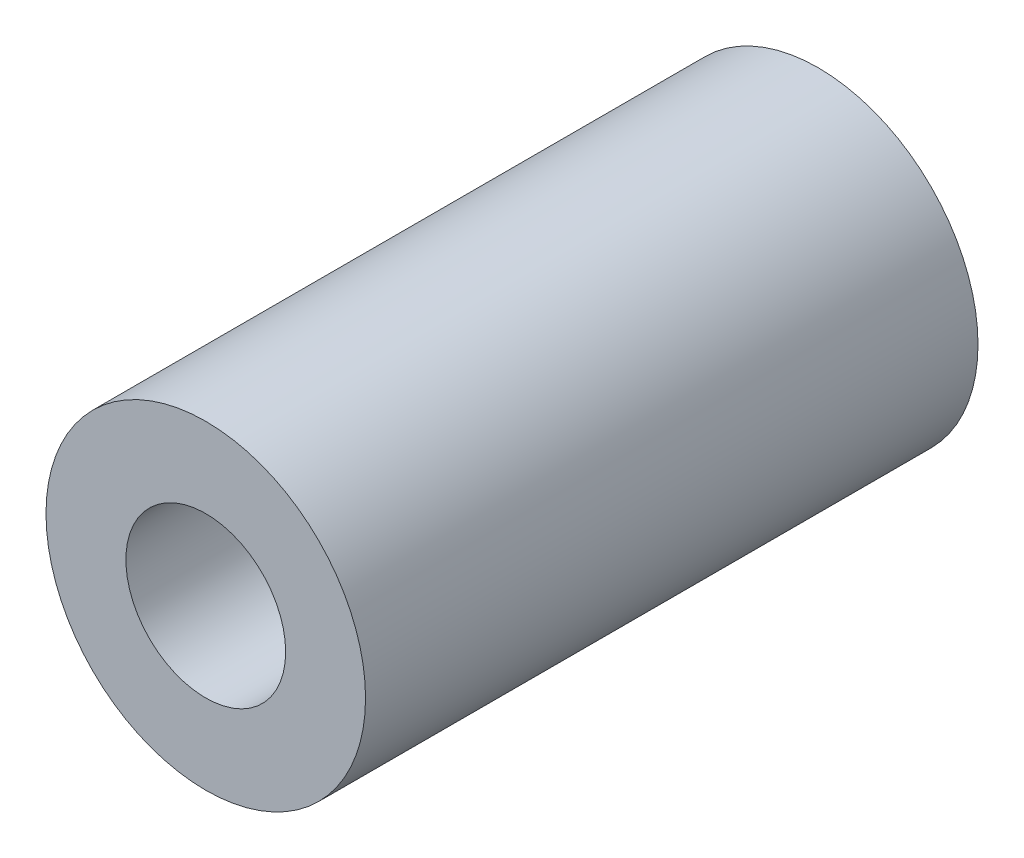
ISO-10303-21;
HEADER;
FILE_DESCRIPTION(('STEP AP214'),'2;1');
FILE_NAME('part.step','',(''),(''),'','','');
FILE_SCHEMA(('AUTOMOTIVE_DESIGN { 1 0 10303 214 1 1 1 1 }'));
ENDSEC;
DATA;
#1=APPLICATION_CONTEXT('core data for automotive mechanical design processes');
#2=APPLICATION_PROTOCOL_DEFINITION('international standard','automotive_design',2000,#1);
#3=PRODUCT_CONTEXT('',#1,'mechanical');
#4=PRODUCT('Part','Part','',(#3));
#5=PRODUCT_RELATED_PRODUCT_CATEGORY('part','',(#4));
#6=PRODUCT_DEFINITION_FORMATION('','',#4);
#7=PRODUCT_DEFINITION_CONTEXT('part definition',#1,'design');
#8=PRODUCT_DEFINITION('design','',#6,#7);
#9=PRODUCT_DEFINITION_SHAPE('','',#8);
#10=(LENGTH_UNIT() NAMED_UNIT(*) SI_UNIT(.MILLI.,.METRE.));
#11=(NAMED_UNIT(*) PLANE_ANGLE_UNIT() SI_UNIT($,.RADIAN.));
#12=(NAMED_UNIT(*) SI_UNIT($,.STERADIAN.) SOLID_ANGLE_UNIT());
#13=UNCERTAINTY_MEASURE_WITH_UNIT(LENGTH_MEASURE(1.E-05),#10,'distance_accuracy_value','');
#14=(GEOMETRIC_REPRESENTATION_CONTEXT(3) GLOBAL_UNCERTAINTY_ASSIGNED_CONTEXT((#13)) GLOBAL_UNIT_ASSIGNED_CONTEXT((#10,
#11,#12)) REPRESENTATION_CONTEXT('',''));
#15=CARTESIAN_POINT('',(0.,0.,0.));
#16=DIRECTION('',(0.,0.,1.));
#17=DIRECTION('',(1.,0.,0.));
#18=AXIS2_PLACEMENT_3D('',#15,#16,#17);
#19=CARTESIAN_POINT('',(0.,0.,40.));
#20=DIRECTION('',(0.,0.,1.));
#21=DIRECTION('',(1.,0.,0.));
#22=AXIS2_PLACEMENT_3D('',#19,#20,#21);
#23=CYLINDRICAL_SURFACE('',#22,3.);
#24=CARTESIAN_POINT('',(0.,0.,13.));
#25=DIRECTION('',(0.,0.,1.));
#26=DIRECTION('',(1.,0.,0.));
#27=AXIS2_PLACEMENT_3D('',#24,#25,#26);
#28=CIRCLE('',#27,3.);
#29=CARTESIAN_POINT('',(3.,0.,13.));
#30=VERTEX_POINT('',#29);
#31=EDGE_CURVE('E26',#30,#30,#28,.T.);
#32=ORIENTED_EDGE('',*,*,#31,.F.);
#33=EDGE_LOOP('',(#32));
#34=FACE_BOUND('',#33,.T.);
#35=CARTESIAN_POINT('',(0.,0.,23.));
#36=DIRECTION('',(0.,0.,1.));
#37=DIRECTION('',(1.,0.,0.));
#38=AXIS2_PLACEMENT_3D('',#35,#36,#37);
#39=CIRCLE('',#38,3.);
#40=CARTESIAN_POINT('',(3.,0.,23.));
#41=VERTEX_POINT('',#40);
#42=EDGE_CURVE('E8',#41,#41,#39,.T.);
#43=ORIENTED_EDGE('',*,*,#42,.T.);
#44=EDGE_LOOP('',(#43));
#45=FACE_BOUND('',#44,.T.);
#46=ADVANCED_FACE('F12',(#34,#45),#23,.F.);
#47=CARTESIAN_POINT('',(6.,0.,23.));
#48=DIRECTION('',(0.,0.,-1.));
#49=DIRECTION('',(-1.,0.,0.));
#50=AXIS2_PLACEMENT_3D('',#47,#48,#49);
#51=PLANE('',#50);
#52=ORIENTED_EDGE('',*,*,#42,.F.);
#53=EDGE_LOOP('',(#52));
#54=FACE_BOUND('',#53,.T.);
#55=CARTESIAN_POINT('',(0.,0.,23.));
#56=DIRECTION('',(0.,0.,1.));
#57=DIRECTION('',(1.,0.,0.));
#58=AXIS2_PLACEMENT_3D('',#55,#56,#57);
#59=CIRCLE('',#58,6.);
#60=CARTESIAN_POINT('',(6.,0.,23.));
#61=VERTEX_POINT('',#60);
#62=EDGE_CURVE('E18',#61,#61,#59,.T.);
#63=ORIENTED_EDGE('',*,*,#62,.T.);
#64=EDGE_LOOP('',(#63));
#65=FACE_BOUND('',#64,.T.);
#66=ADVANCED_FACE('F35',(#54,#65),#51,.F.);
#67=CARTESIAN_POINT('',(0.,0.,40.));
#68=DIRECTION('',(0.,0.,1.));
#69=DIRECTION('',(1.,0.,0.));
#70=AXIS2_PLACEMENT_3D('',#67,#68,#69);
#71=CYLINDRICAL_SURFACE('',#70,6.);
#72=ORIENTED_EDGE('',*,*,#62,.F.);
#73=EDGE_LOOP('',(#72));
#74=FACE_BOUND('',#73,.T.);
#75=CARTESIAN_POINT('',(0.,0.,0.));
#76=DIRECTION('',(0.,0.,1.));
#77=DIRECTION('',(1.,0.,0.));
#78=AXIS2_PLACEMENT_3D('',#75,#76,#77);
#79=CIRCLE('',#78,6.);
#80=CARTESIAN_POINT('',(6.,0.,0.));
#81=VERTEX_POINT('',#80);
#82=EDGE_CURVE('E22',#81,#81,#79,.T.);
#83=ORIENTED_EDGE('',*,*,#82,.T.);
#84=EDGE_LOOP('',(#83));
#85=FACE_BOUND('',#84,.T.);
#86=ADVANCED_FACE('F40',(#74,#85),#71,.T.);
#87=CARTESIAN_POINT('',(2.75,0.,0.));
#88=DIRECTION('',(0.,0.,1.));
#89=DIRECTION('',(1.,0.,0.));
#90=AXIS2_PLACEMENT_3D('',#87,#88,#89);
#91=PLANE('',#90);
#92=ORIENTED_EDGE('',*,*,#82,.F.);
#93=EDGE_LOOP('',(#92));
#94=FACE_BOUND('',#93,.T.);
#95=ADVANCED_FACE('F45',(#94),#91,.F.);
#96=CARTESIAN_POINT('',(0.,0.,13.));
#97=DIRECTION('',(0.,0.,1.));
#98=DIRECTION('',(1.,0.,0.));
#99=AXIS2_PLACEMENT_3D('',#96,#97,#98);
#100=PLANE('',#99);
#101=ORIENTED_EDGE('',*,*,#31,.T.);
#102=EDGE_LOOP('',(#101));
#103=FACE_BOUND('',#102,.T.);
#104=ADVANCED_FACE('F32',(#103),#100,.T.);
#105=CLOSED_SHELL('',(#46,#66,#86,#95,#104));
#106=MANIFOLD_SOLID_BREP('B1',#105);
#107=ADVANCED_BREP_SHAPE_REPRESENTATION('',(#18,#106),#14);
#108=SHAPE_DEFINITION_REPRESENTATION(#9,#107);
ENDSEC;
END-ISO-10303-21;
